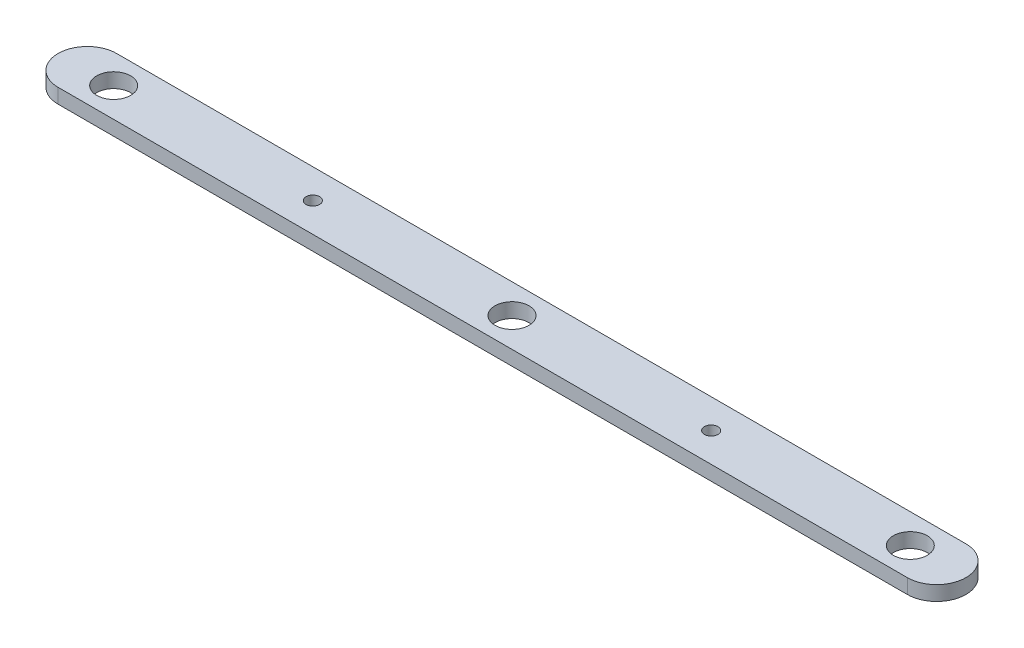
ISO-10303-21;
HEADER;
FILE_DESCRIPTION(('STEP AP214'),'2;1');
FILE_NAME('part.step','',(''),(''),'','','');
FILE_SCHEMA(('AUTOMOTIVE_DESIGN { 1 0 10303 214 1 1 1 1 }'));
ENDSEC;
DATA;
#1=APPLICATION_CONTEXT('core data for automotive mechanical design processes');
#2=APPLICATION_PROTOCOL_DEFINITION('international standard','automotive_design',2000,#1);
#3=PRODUCT_CONTEXT('',#1,'mechanical');
#4=PRODUCT('Part','Part','',(#3));
#5=PRODUCT_RELATED_PRODUCT_CATEGORY('part','',(#4));
#6=PRODUCT_DEFINITION_FORMATION('','',#4);
#7=PRODUCT_DEFINITION_CONTEXT('part definition',#1,'design');
#8=PRODUCT_DEFINITION('design','',#6,#7);
#9=PRODUCT_DEFINITION_SHAPE('','',#8);
#10=(LENGTH_UNIT() NAMED_UNIT(*) SI_UNIT(.MILLI.,.METRE.));
#11=(NAMED_UNIT(*) PLANE_ANGLE_UNIT() SI_UNIT($,.RADIAN.));
#12=(NAMED_UNIT(*) SI_UNIT($,.STERADIAN.) SOLID_ANGLE_UNIT());
#13=UNCERTAINTY_MEASURE_WITH_UNIT(LENGTH_MEASURE(1.E-05),#10,'distance_accuracy_value','');
#14=(GEOMETRIC_REPRESENTATION_CONTEXT(3) GLOBAL_UNCERTAINTY_ASSIGNED_CONTEXT((#13)) GLOBAL_UNIT_ASSIGNED_CONTEXT((#10,
#11,#12)) REPRESENTATION_CONTEXT('',''));
#15=CARTESIAN_POINT('',(0.,0.,0.));
#16=DIRECTION('',(0.,0.,1.));
#17=DIRECTION('',(1.,0.,0.));
#18=AXIS2_PLACEMENT_3D('',#15,#16,#17);
#19=CARTESIAN_POINT('',(0.,3.175,0.));
#20=DIRECTION('',(0.,1.,0.));
#21=DIRECTION('',(0.,0.,1.));
#22=AXIS2_PLACEMENT_3D('',#19,#20,#21);
#23=PLANE('',#22);
#24=CARTESIAN_POINT('',(48.895,3.175,0.));
#25=DIRECTION('',(0.,1.,0.));
#26=DIRECTION('',(0.,0.,1.));
#27=AXIS2_PLACEMENT_3D('',#24,#25,#26);
#28=CIRCLE('',#27,1.47319999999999);
#29=CARTESIAN_POINT('',(48.895,3.175,1.47319999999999));
#30=VERTEX_POINT('',#29);
#31=EDGE_CURVE('E138',#30,#30,#28,.T.);
#32=ORIENTED_EDGE('',*,*,#31,.F.);
#33=EDGE_LOOP('',(#32));
#34=FACE_BOUND('',#33,.T.);
#35=CARTESIAN_POINT('',(135.255,3.175,0.));
#36=DIRECTION('',(0.,1.,0.));
#37=DIRECTION('',(0.,0.,1.));
#38=AXIS2_PLACEMENT_3D('',#35,#36,#37);
#39=CIRCLE('',#38,1.47319999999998);
#40=CARTESIAN_POINT('',(135.255,3.175,1.47319999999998));
#41=VERTEX_POINT('',#40);
#42=EDGE_CURVE('E132',#41,#41,#39,.T.);
#43=ORIENTED_EDGE('',*,*,#42,.F.);
#44=EDGE_LOOP('',(#43));
#45=FACE_BOUND('',#44,.T.);
#46=CARTESIAN_POINT('',(5.71500000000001,3.175,0.));
#47=DIRECTION('',(0.,1.,0.));
#48=DIRECTION('',(0.,0.,1.));
#49=AXIS2_PLACEMENT_3D('',#46,#47,#48);
#50=CIRCLE('',#49,3.683);
#51=CARTESIAN_POINT('',(5.71500000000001,3.175,3.683));
#52=VERTEX_POINT('',#51);
#53=EDGE_CURVE('E115',#52,#52,#50,.T.);
#54=ORIENTED_EDGE('',*,*,#53,.F.);
#55=EDGE_LOOP('',(#54));
#56=FACE_BOUND('',#55,.T.);
#57=CARTESIAN_POINT('',(0.,3.175,0.));
#58=DIRECTION('',(0.,1.,0.));
#59=DIRECTION('',(0.,0.,1.));
#60=AXIS2_PLACEMENT_3D('',#57,#58,#59);
#61=CIRCLE('',#60,6.35);
#62=CARTESIAN_POINT('',(0.,3.175,-6.35));
#63=VERTEX_POINT('',#62);
#64=CARTESIAN_POINT('',(0.,3.175,6.35));
#65=VERTEX_POINT('',#64);
#66=EDGE_CURVE('E85',#63,#65,#61,.T.);
#67=ORIENTED_EDGE('',*,*,#66,.T.);
#68=DIRECTION('',(1.,0.,0.));
#69=VECTOR('',#68,1.);
#70=CARTESIAN_POINT('',(0.,3.175,6.35));
#71=LINE('',#70,#69);
#72=CARTESIAN_POINT('',(184.15,3.175,6.35));
#73=VERTEX_POINT('',#72);
#74=EDGE_CURVE('E80',#65,#73,#71,.T.);
#75=ORIENTED_EDGE('',*,*,#74,.T.);
#76=CARTESIAN_POINT('',(184.15,3.175,0.));
#77=DIRECTION('',(0.,1.,0.));
#78=DIRECTION('',(0.,0.,1.));
#79=AXIS2_PLACEMENT_3D('',#76,#77,#78);
#80=CIRCLE('',#79,6.35);
#81=CARTESIAN_POINT('',(184.15,3.175,-6.35));
#82=VERTEX_POINT('',#81);
#83=EDGE_CURVE('E83',#73,#82,#80,.T.);
#84=ORIENTED_EDGE('',*,*,#83,.T.);
#85=DIRECTION('',(-1.,0.,0.));
#86=VECTOR('',#85,1.);
#87=CARTESIAN_POINT('',(0.,3.175,-6.35));
#88=LINE('',#87,#86);
#89=EDGE_CURVE('E50',#82,#63,#88,.T.);
#90=ORIENTED_EDGE('',*,*,#89,.T.);
#91=EDGE_LOOP('',(#67,#75,#84,#90));
#92=FACE_BOUND('',#91,.T.);
#93=CARTESIAN_POINT('',(92.075,3.175,0.));
#94=DIRECTION('',(0.,1.,0.));
#95=DIRECTION('',(0.,0.,1.));
#96=AXIS2_PLACEMENT_3D('',#93,#94,#95);
#97=CIRCLE('',#96,3.683);
#98=CARTESIAN_POINT('',(92.075,3.175,3.683));
#99=VERTEX_POINT('',#98);
#100=EDGE_CURVE('E100',#99,#99,#97,.T.);
#101=ORIENTED_EDGE('',*,*,#100,.F.);
#102=EDGE_LOOP('',(#101));
#103=FACE_BOUND('',#102,.T.);
#104=CARTESIAN_POINT('',(178.435,3.175,0.));
#105=DIRECTION('',(0.,1.,0.));
#106=DIRECTION('',(0.,0.,1.));
#107=AXIS2_PLACEMENT_3D('',#104,#105,#106);
#108=CIRCLE('',#107,3.683);
#109=CARTESIAN_POINT('',(178.435,3.175,3.683));
#110=VERTEX_POINT('',#109);
#111=EDGE_CURVE('E121',#110,#110,#108,.T.);
#112=ORIENTED_EDGE('',*,*,#111,.F.);
#113=EDGE_LOOP('',(#112));
#114=FACE_BOUND('',#113,.T.);
#115=ADVANCED_FACE('F33',(#34,#45,#56,#92,#103,#114),#23,.T.);
#116=CARTESIAN_POINT('',(0.,0.,0.));
#117=DIRECTION('',(0.,1.,0.));
#118=DIRECTION('',(0.,0.,1.));
#119=AXIS2_PLACEMENT_3D('',#116,#117,#118);
#120=PLANE('',#119);
#121=CARTESIAN_POINT('',(48.895,0.,0.));
#122=DIRECTION('',(0.,1.,0.));
#123=DIRECTION('',(0.,0.,1.));
#124=AXIS2_PLACEMENT_3D('',#121,#122,#123);
#125=CIRCLE('',#124,1.4732);
#126=CARTESIAN_POINT('',(48.895,0.,1.4732));
#127=VERTEX_POINT('',#126);
#128=EDGE_CURVE('E135',#127,#127,#125,.T.);
#129=ORIENTED_EDGE('',*,*,#128,.T.);
#130=EDGE_LOOP('',(#129));
#131=FACE_BOUND('',#130,.T.);
#132=CARTESIAN_POINT('',(135.255,0.,0.));
#133=DIRECTION('',(0.,1.,0.));
#134=DIRECTION('',(0.,0.,1.));
#135=AXIS2_PLACEMENT_3D('',#132,#133,#134);
#136=CIRCLE('',#135,1.47320000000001);
#137=CARTESIAN_POINT('',(135.255,0.,1.47320000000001));
#138=VERTEX_POINT('',#137);
#139=EDGE_CURVE('E127',#138,#138,#136,.T.);
#140=ORIENTED_EDGE('',*,*,#139,.T.);
#141=EDGE_LOOP('',(#140));
#142=FACE_BOUND('',#141,.T.);
#143=CARTESIAN_POINT('',(5.71500000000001,0.,0.));
#144=DIRECTION('',(0.,1.,0.));
#145=DIRECTION('',(0.,0.,1.));
#146=AXIS2_PLACEMENT_3D('',#143,#144,#145);
#147=CIRCLE('',#146,3.683);
#148=CARTESIAN_POINT('',(5.71500000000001,0.,3.683));
#149=VERTEX_POINT('',#148);
#150=EDGE_CURVE('E118',#149,#149,#147,.T.);
#151=ORIENTED_EDGE('',*,*,#150,.T.);
#152=EDGE_LOOP('',(#151));
#153=FACE_BOUND('',#152,.T.);
#154=CARTESIAN_POINT('',(0.,0.,0.));
#155=DIRECTION('',(0.,1.,0.));
#156=DIRECTION('',(0.,0.,1.));
#157=AXIS2_PLACEMENT_3D('',#154,#155,#156);
#158=CIRCLE('',#157,6.35);
#159=CARTESIAN_POINT('',(0.,0.,-6.35));
#160=VERTEX_POINT('',#159);
#161=CARTESIAN_POINT('',(0.,0.,6.35));
#162=VERTEX_POINT('',#161);
#163=EDGE_CURVE('E97',#160,#162,#158,.T.);
#164=ORIENTED_EDGE('',*,*,#163,.F.);
#165=DIRECTION('',(-1.,0.,0.));
#166=VECTOR('',#165,1.);
#167=CARTESIAN_POINT('',(0.,0.,-6.35));
#168=LINE('',#167,#166);
#169=CARTESIAN_POINT('',(184.15,0.,-6.35));
#170=VERTEX_POINT('',#169);
#171=EDGE_CURVE('E73',#170,#160,#168,.T.);
#172=ORIENTED_EDGE('',*,*,#171,.F.);
#173=CARTESIAN_POINT('',(184.15,0.,0.));
#174=DIRECTION('',(0.,1.,0.));
#175=DIRECTION('',(0.,0.,1.));
#176=AXIS2_PLACEMENT_3D('',#173,#174,#175);
#177=CIRCLE('',#176,6.35);
#178=CARTESIAN_POINT('',(184.15,0.,6.35));
#179=VERTEX_POINT('',#178);
#180=EDGE_CURVE('E67',#179,#170,#177,.T.);
#181=ORIENTED_EDGE('',*,*,#180,.F.);
#182=DIRECTION('',(1.,0.,0.));
#183=VECTOR('',#182,1.);
#184=CARTESIAN_POINT('',(0.,0.,6.35));
#185=LINE('',#184,#183);
#186=EDGE_CURVE('E89',#162,#179,#185,.T.);
#187=ORIENTED_EDGE('',*,*,#186,.F.);
#188=EDGE_LOOP('',(#164,#172,#181,#187));
#189=FACE_BOUND('',#188,.T.);
#190=CARTESIAN_POINT('',(92.075,0.,0.));
#191=DIRECTION('',(0.,1.,0.));
#192=DIRECTION('',(0.,0.,1.));
#193=AXIS2_PLACEMENT_3D('',#190,#191,#192);
#194=CIRCLE('',#193,3.683);
#195=CARTESIAN_POINT('',(92.075,0.,3.683));
#196=VERTEX_POINT('',#195);
#197=EDGE_CURVE('E112',#196,#196,#194,.T.);
#198=ORIENTED_EDGE('',*,*,#197,.T.);
#199=EDGE_LOOP('',(#198));
#200=FACE_BOUND('',#199,.T.);
#201=CARTESIAN_POINT('',(178.435,0.,0.));
#202=DIRECTION('',(0.,1.,0.));
#203=DIRECTION('',(0.,0.,1.));
#204=AXIS2_PLACEMENT_3D('',#201,#202,#203);
#205=CIRCLE('',#204,3.683);
#206=CARTESIAN_POINT('',(178.435,0.,3.683));
#207=VERTEX_POINT('',#206);
#208=EDGE_CURVE('E124',#207,#207,#205,.T.);
#209=ORIENTED_EDGE('',*,*,#208,.T.);
#210=EDGE_LOOP('',(#209));
#211=FACE_BOUND('',#210,.T.);
#212=ADVANCED_FACE('F108',(#131,#142,#153,#189,#200,#211),#120,.F.);
#213=CARTESIAN_POINT('',(0.,3.175,0.));
#214=DIRECTION('',(0.,-1.,0.));
#215=DIRECTION('',(0.,0.,-1.));
#216=AXIS2_PLACEMENT_3D('',#213,#214,#215);
#217=CYLINDRICAL_SURFACE('',#216,6.35);
#218=ORIENTED_EDGE('',*,*,#163,.T.);
#219=DIRECTION('',(0.,-1.,0.));
#220=VECTOR('',#219,1.);
#221=CARTESIAN_POINT('',(0.,3.175,6.35));
#222=LINE('',#221,#220);
#223=EDGE_CURVE('E11',#65,#162,#222,.T.);
#224=ORIENTED_EDGE('',*,*,#223,.F.);
#225=ORIENTED_EDGE('',*,*,#66,.F.);
#226=DIRECTION('',(0.,-1.,0.));
#227=VECTOR('',#226,1.);
#228=CARTESIAN_POINT('',(0.,3.175,-6.35));
#229=LINE('',#228,#227);
#230=EDGE_CURVE('E93',#63,#160,#229,.T.);
#231=ORIENTED_EDGE('',*,*,#230,.T.);
#232=EDGE_LOOP('',(#218,#224,#225,#231));
#233=FACE_BOUND('',#232,.T.);
#234=ADVANCED_FACE('F35',(#233),#217,.T.);
#235=CARTESIAN_POINT('',(0.,3.175,6.35));
#236=DIRECTION('',(0.,0.,-1.));
#237=DIRECTION('',(-1.,0.,0.));
#238=AXIS2_PLACEMENT_3D('',#235,#236,#237);
#239=PLANE('',#238);
#240=ORIENTED_EDGE('',*,*,#186,.T.);
#241=DIRECTION('',(0.,-1.,0.));
#242=VECTOR('',#241,1.);
#243=CARTESIAN_POINT('',(184.15,3.175,6.35));
#244=LINE('',#243,#242);
#245=EDGE_CURVE('E42',#73,#179,#244,.T.);
#246=ORIENTED_EDGE('',*,*,#245,.F.);
#247=ORIENTED_EDGE('',*,*,#74,.F.);
#248=ORIENTED_EDGE('',*,*,#223,.T.);
#249=EDGE_LOOP('',(#240,#246,#247,#248));
#250=FACE_BOUND('',#249,.T.);
#251=ADVANCED_FACE('F88',(#250),#239,.F.);
#252=CARTESIAN_POINT('',(184.15,3.175,0.));
#253=DIRECTION('',(0.,-1.,0.));
#254=DIRECTION('',(0.,0.,-1.));
#255=AXIS2_PLACEMENT_3D('',#252,#253,#254);
#256=CYLINDRICAL_SURFACE('',#255,6.35);
#257=ORIENTED_EDGE('',*,*,#180,.T.);
#258=DIRECTION('',(0.,-1.,0.));
#259=VECTOR('',#258,1.);
#260=CARTESIAN_POINT('',(184.15,3.175,-6.35));
#261=LINE('',#260,#259);
#262=EDGE_CURVE('E90',#82,#170,#261,.T.);
#263=ORIENTED_EDGE('',*,*,#262,.F.);
#264=ORIENTED_EDGE('',*,*,#83,.F.);
#265=ORIENTED_EDGE('',*,*,#245,.T.);
#266=EDGE_LOOP('',(#257,#263,#264,#265));
#267=FACE_BOUND('',#266,.T.);
#268=ADVANCED_FACE('F91',(#267),#256,.T.);
#269=CARTESIAN_POINT('',(0.,3.175,-6.35));
#270=DIRECTION('',(0.,0.,1.));
#271=DIRECTION('',(1.,0.,0.));
#272=AXIS2_PLACEMENT_3D('',#269,#270,#271);
#273=PLANE('',#272);
#274=ORIENTED_EDGE('',*,*,#171,.T.);
#275=ORIENTED_EDGE('',*,*,#230,.F.);
#276=ORIENTED_EDGE('',*,*,#89,.F.);
#277=ORIENTED_EDGE('',*,*,#262,.T.);
#278=EDGE_LOOP('',(#274,#275,#276,#277));
#279=FACE_BOUND('',#278,.T.);
#280=ADVANCED_FACE('F105',(#279),#273,.F.);
#281=CARTESIAN_POINT('',(92.075,3.175,0.));
#282=DIRECTION('',(0.,-1.,0.));
#283=DIRECTION('',(0.,0.,-1.));
#284=AXIS2_PLACEMENT_3D('',#281,#282,#283);
#285=CYLINDRICAL_SURFACE('',#284,3.683);
#286=ORIENTED_EDGE('',*,*,#100,.T.);
#287=EDGE_LOOP('',(#286));
#288=FACE_BOUND('',#287,.T.);
#289=ORIENTED_EDGE('',*,*,#197,.F.);
#290=EDGE_LOOP('',(#289));
#291=FACE_BOUND('',#290,.T.);
#292=ADVANCED_FACE('F155',(#288,#291),#285,.F.);
#293=CARTESIAN_POINT('',(5.71500000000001,3.175,0.));
#294=DIRECTION('',(0.,-1.,0.));
#295=DIRECTION('',(0.,0.,-1.));
#296=AXIS2_PLACEMENT_3D('',#293,#294,#295);
#297=CYLINDRICAL_SURFACE('',#296,3.683);
#298=ORIENTED_EDGE('',*,*,#53,.T.);
#299=EDGE_LOOP('',(#298));
#300=FACE_BOUND('',#299,.T.);
#301=ORIENTED_EDGE('',*,*,#150,.F.);
#302=EDGE_LOOP('',(#301));
#303=FACE_BOUND('',#302,.T.);
#304=ADVANCED_FACE('F151',(#300,#303),#297,.F.);
#305=CARTESIAN_POINT('',(178.435,3.175,0.));
#306=DIRECTION('',(0.,-1.,0.));
#307=DIRECTION('',(0.,0.,-1.));
#308=AXIS2_PLACEMENT_3D('',#305,#306,#307);
#309=CYLINDRICAL_SURFACE('',#308,3.683);
#310=ORIENTED_EDGE('',*,*,#111,.T.);
#311=EDGE_LOOP('',(#310));
#312=FACE_BOUND('',#311,.T.);
#313=ORIENTED_EDGE('',*,*,#208,.F.);
#314=EDGE_LOOP('',(#313));
#315=FACE_BOUND('',#314,.T.);
#316=ADVANCED_FACE('F154',(#312,#315),#309,.F.);
#317=CARTESIAN_POINT('',(135.255,3.175,0.));
#318=DIRECTION('',(0.,1.,0.));
#319=DIRECTION('',(0.,0.,1.));
#320=AXIS2_PLACEMENT_3D('',#317,#318,#319);
#321=CYLINDRICAL_SURFACE('',#320,1.47319999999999);
#322=ORIENTED_EDGE('',*,*,#139,.F.);
#323=EDGE_LOOP('',(#322));
#324=FACE_BOUND('',#323,.T.);
#325=ORIENTED_EDGE('',*,*,#42,.T.);
#326=EDGE_LOOP('',(#325));
#327=FACE_BOUND('',#326,.T.);
#328=ADVANCED_FACE('F200',(#324,#327),#321,.F.);
#329=CARTESIAN_POINT('',(48.895,3.175,0.));
#330=DIRECTION('',(0.,1.,0.));
#331=DIRECTION('',(0.,0.,1.));
#332=AXIS2_PLACEMENT_3D('',#329,#330,#331);
#333=CYLINDRICAL_SURFACE('',#332,1.47319999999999);
#334=ORIENTED_EDGE('',*,*,#128,.F.);
#335=EDGE_LOOP('',(#334));
#336=FACE_BOUND('',#335,.T.);
#337=ORIENTED_EDGE('',*,*,#31,.T.);
#338=EDGE_LOOP('',(#337));
#339=FACE_BOUND('',#338,.T.);
#340=ADVANCED_FACE('F142',(#336,#339),#333,.F.);
#341=CLOSED_SHELL('',(#115,#212,#234,#251,#268,#280,#292,#304,#316,#328,#340));
#342=MANIFOLD_SOLID_BREP('B2',#341);
#343=ADVANCED_BREP_SHAPE_REPRESENTATION('',(#18,#342),#14);
#344=SHAPE_DEFINITION_REPRESENTATION(#9,#343);
ENDSEC;
END-ISO-10303-21;
